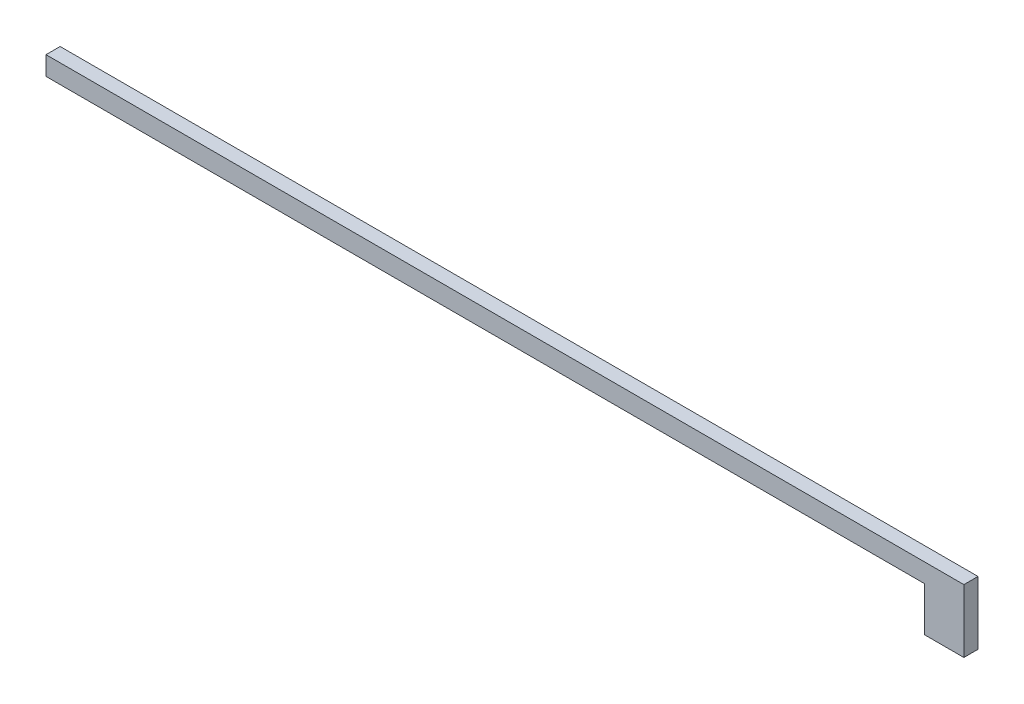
from build123d import *

# Parameters (mm, degrees)
EXTRUDE1_DEPTH = 3.81


with BuildPart() as part:
    # Sketch1 → Extrude1 (new body)
    with BuildSketch(Plane.XY):
        Polygon((-122.621316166, 19.304363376), (114.106683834, 19.304363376), (114.106683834, 7.366363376), (124.774683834, 7.366363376), (124.774683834, 19.304363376), (124.774683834, 24.384363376), (-122.621316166, 24.384363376), align=None)
    extrude(amount=EXTRUDE1_DEPTH)


solid = part.part
